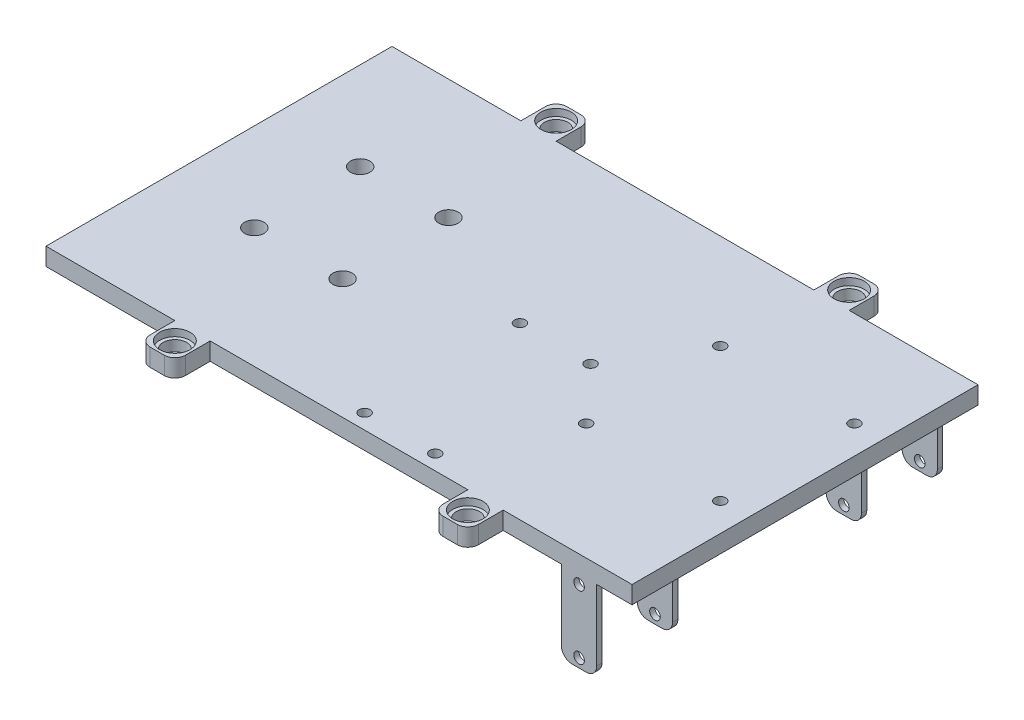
from build123d import *

# Parameters (mm, degrees)
SKETCH1_W           = 166
SKETCH1_H           = 98
BOSS_EXTRUDE2_DEPTH = 5
SKETCH1_5_W         = 10
SKETCH1_5_H         = 10
BOSS_EXTRUDE3_DEPTH = 5
SKETCH2_R           = 3.3
CUT_EXTRUDE1_DEPTH  = 5
SKETCH4_R           = 2.75
CUT_EXTRUDE2_DEPTH  = 10
SKETCH5_R           = 1.55
CUT_EXTRUDE3_DEPTH  = 5
SKETCH13_W          = 10
SKETCH13_H          = 1.5
BOSS_EXTRUDE6_DEPTH = 23
SKETCH14_R          = 1.5
CUT_EXTRUDE4_DEPTH  = 100
SKETCH3_R           = 4.3
CUT_EXTRUDE5_DEPTH  = 2
FILLET4_R           = 3
FILLET5_R           = 3


with BuildPart() as part:
    # Sketch1 → Boss-Extrude2 (new body)
    with BuildSketch(Plane(origin=(0, 0, 0), x_dir=(1, 0, 0), z_dir=(0, 1, 0))):
        with Locations((23.896203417, -4.141642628)):
            Rectangle(SKETCH1_W, SKETCH1_H)
    extrude(amount=-BOSS_EXTRUDE2_DEPTH)

    # Sketch1_5 → Boss-Extrude3 (add)
    with BuildSketch(Plane(origin=(0, 0, 0), x_dir=(1, 0, 0), z_dir=(0, 1, 0))):
        with Locations((-17.603796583, 49.858357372)):
            Rectangle(SKETCH1_5_W, SKETCH1_5_H)
        with Locations((-17.603796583, -58.141642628)):
            Rectangle(SKETCH1_5_W, SKETCH1_5_H)
        with Locations((65.396203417, 49.858357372)):
            Rectangle(SKETCH1_5_W, SKETCH1_5_H)
        with Locations((65.396203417, -58.141642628)):
            Rectangle(SKETCH1_5_W, SKETCH1_5_H)
    extrude(amount=-BOSS_EXTRUDE3_DEPTH)

    # Sketch2 → Cut-Extrude1 (cut)
    with BuildSketch(Plane(origin=(0, 0, 0), x_dir=(1, 0, 0), z_dir=(0, 1, 0))):
        with Locations(Location((-17.603796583, 49.858357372, 0), (0, 0, 270))):
            Circle(SKETCH2_R)
        with Locations(Location((65.396203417, 49.858357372, 0), (0, 0, 270))):
            Circle(SKETCH2_R)
        with Locations(Location((65.396203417, -58.141642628, 0), (0, 0, 90))):
            Circle(SKETCH2_R)
        with Locations(Location((-17.603796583, -58.141642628, 0), (0, 0, 90))):
            Circle(SKETCH2_R)
    extrude(amount=-CUT_EXTRUDE1_DEPTH, mode=Mode.SUBTRACT)

    # Sketch4 → Cut-Extrude2 (cut)
    with BuildSketch(Plane(origin=(0, 0, 0), x_dir=(1, 0, 0), z_dir=(0, 1, 0))):
        with Locations(Location((-34.103796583, 10.858357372, 0), (0, 0, 270))):
            Circle(SKETCH4_R)
        with Locations(Location((-34.103796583, -19.141642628, 0), (0, 0, 270))):
            Circle(SKETCH4_R)
        with Locations(Location((-9.103796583, 10.858357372, 0), (0, 0, 270))):
            Circle(SKETCH4_R)
        with Locations(Location((-9.103796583, -19.141642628, 0), (0, 0, 270))):
            Circle(SKETCH4_R)
    extrude(amount=-CUT_EXTRUDE2_DEPTH, mode=Mode.SUBTRACT)

    # Sketch5 → Cut-Extrude3 (cut)
    with BuildSketch(Plane(origin=(0, 0, 0), x_dir=(1, 0, 0), z_dir=(0, 1, 0))):
        with Locations(Location((26.896203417, -48.891642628, 0), (0, 0, 270))):
            Circle(SKETCH5_R)
        with Locations(Location((26.896203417, -4.891642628, 0), (0, 0, 270))):
            Circle(SKETCH5_R)
        with Locations(Location((46.896203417, -4.891642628, 0), (0, 0, 270))):
            Circle(SKETCH5_R)
        with Locations(Location((46.896203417, -48.891642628, 0), (0, 0, 270))):
            Circle(SKETCH5_R)
        with Locations(Location((60.896203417, 17.858357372, 0), (0, 0, 270))):
            Circle(SKETCH5_R)
        with Locations(Location((60.896203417, -20.141642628, 0), (0, 0, 270))):
            Circle(SKETCH5_R)
        with Locations(Location((98.896203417, 17.858357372, 0), (0, 0, 270))):
            Circle(SKETCH5_R)
        with Locations(Location((98.896203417, -20.141642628, 0), (0, 0, 270))):
            Circle(SKETCH5_R)
    extrude(amount=-CUT_EXTRUDE3_DEPTH, mode=Mode.SUBTRACT)

    # Sketch13 → Boss-Extrude6 (add)
    with BuildSketch(Plane.XZ.offset(5)):
        with Locations((91.896203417, 52.391642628)):
            Rectangle(SKETCH13_W, SKETCH13_H)
        with Locations((91.896203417, -44.108357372)):
            Rectangle(SKETCH13_W, SKETCH13_H)
        with Locations((91.896203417, -22.608357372)):
            Rectangle(SKETCH13_W, SKETCH13_H)
        with Locations((91.896203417, 30.891642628)):
            Rectangle(SKETCH13_W, SKETCH13_H)
    extrude(amount=BOSS_EXTRUDE6_DEPTH)

    # Sketch14 → Cut-Extrude4 (cut)
    with BuildSketch(Plane.XY.offset(53.141642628)):
        with Locations((91.896203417, -25.5)):
            Circle(SKETCH14_R)
        with Locations((91.896203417, -7.5)):
            Circle(SKETCH14_R)
    extrude(amount=-CUT_EXTRUDE4_DEPTH, mode=Mode.SUBTRACT)

    # Sketch3 → Cut-Extrude5 (cut)
    with BuildSketch(Plane(origin=(0, 0, 0), x_dir=(1, 0, 0), z_dir=(0, 1, 0))):
        with Locations(Location((-17.603796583, -58.141642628, 0), (0, 0, 270))):
            Circle(SKETCH3_R)
        with Locations(Location((-17.603796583, 49.858357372, 0), (0, 0, 90))):
            Circle(SKETCH3_R)
        with Locations(Location((65.396203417, 49.858357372, 0), (0, 0, 270))):
            Circle(SKETCH3_R)
        with Locations(Location((65.396203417, -58.141642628, 0), (0, 0, 90))):
            Circle(SKETCH3_R)
    extrude(amount=-CUT_EXTRUDE5_DEPTH, mode=Mode.SUBTRACT)

    # Fillet4
    fillet4_edges = [part.edges().sort_by_distance(p)[0] for p in [
        (86.896203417, -28, 52.391642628),
        (96.896203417, -28, 52.391642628),
        (96.896203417, -28, -44.108357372),
        (86.896203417, -28, -44.108357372),
        (96.896203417, -28, 30.891642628),
        (86.896203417, -28, 30.891642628),
        (96.896203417, -28, -22.608357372),
        (86.896203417, -28, -22.608357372),
    ]]
    fillet(fillet4_edges, radius=FILLET4_R)

    # Fillet5
    fillet5_edges = [part.edges().sort_by_distance(p)[0] for p in [
        (-22.603796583, -2.5, 63.141642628),
        (-12.603796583, -2.5, 63.141642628),
        (-22.603796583, -2.5, -54.858357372),
        (-12.603796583, -2.5, -54.858357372),
        (60.396203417, -2.5, -54.858357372),
        (70.396203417, -2.5, -54.858357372),
        (70.396203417, -2.5, 63.141642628),
        (60.396203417, -2.5, 63.141642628),
    ]]
    fillet(fillet5_edges, radius=FILLET5_R)


solid = part.part
